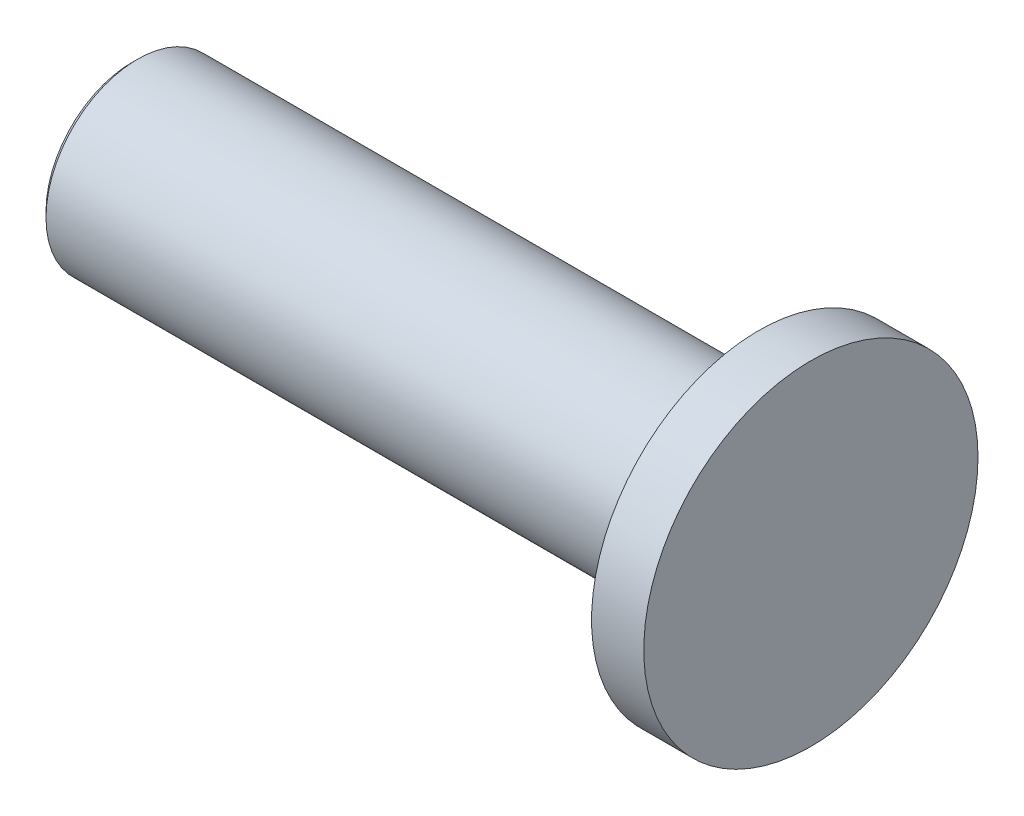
from build123d import *

# Parameters (mm, degrees)
SKETCH1_W           = 25
SKETCH1_H           = 80
SCALE1_SCALE        = 0.75
SKETCH3_R           = 32.88
BOSS_EXTRUDE2_DEPTH = 225
CHAMFER2_SIZE       = 2


with BuildPart() as part:
    # Sketch1 → Revolve1 (revolve)
    with BuildSketch(Plane.XY, mode=Mode.PRIVATE) as revolve1_sk:
        with Locations((121.5, 40)):
            Rectangle(SKETCH1_W, SKETCH1_H)
    revolve(revolve1_sk.sketch.rotate(Axis((109, 0, 0), (1, 0, 0)), 270), axis=Axis((109, 0, 0), (1, 0, 0)))


with BuildPart() as part_1:
    # Scale1: scaled about (121.5, 0, 0)
    add(part.part.scale(SCALE1_SCALE).moved(Location((30.375, 0, 0))))

    # Sketch3 → Boss-Extrude2 (add)
    with BuildSketch(Plane.ZY.offset(-112.125)):
        Circle(SKETCH3_R)
    extrude(amount=BOSS_EXTRUDE2_DEPTH)

    # Chamfer2
    chamfer2_edges = [part_1.edges().sort_by_distance(p)[0] for p in [
        (-112.875, 0, -32.88),
    ]]
    chamfer(chamfer2_edges, length=CHAMFER2_SIZE)


solid = part_1.part
